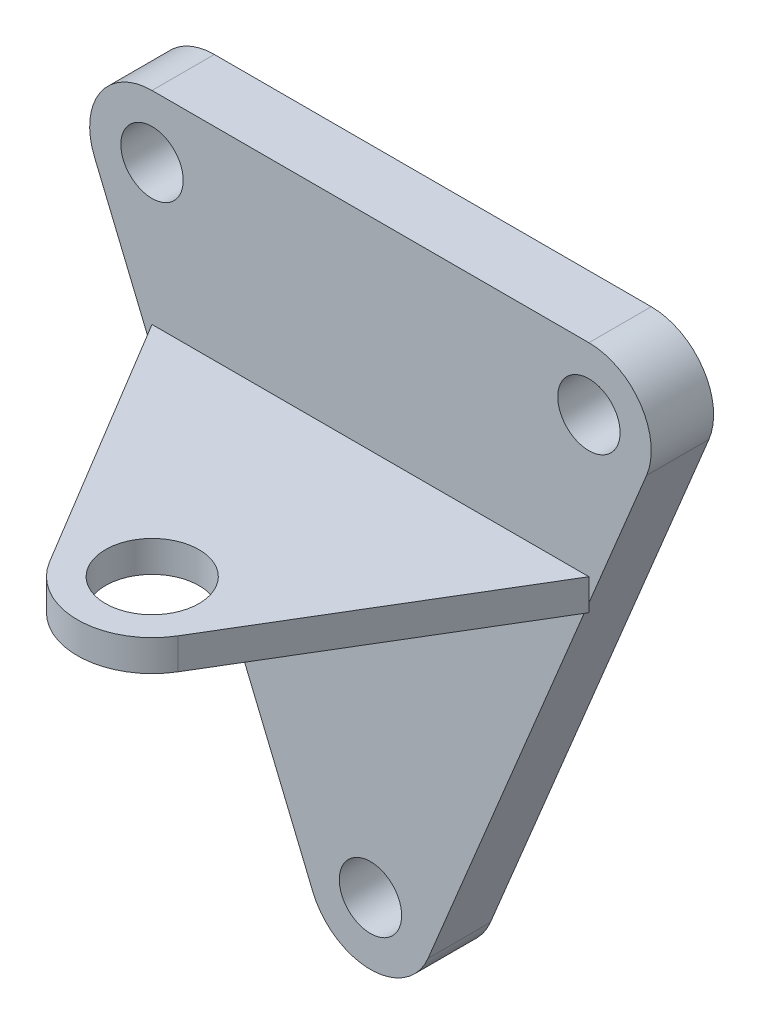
from build123d import *

# Parameters (mm, degrees)
SKETCH1_R      = 5
EXTRUDE1_DEPTH = 10
SKETCH3_R      = 7.5
EXTRUDE3_DEPTH = 2.5


with BuildPart() as part:
    # Sketch1 → Extrude1 (new body)
    with BuildSketch(Plane.XY):
        with BuildLine():
            Line((-35.033942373, 0), (35.033942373, 0))
            ThreePointArc((35.033942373, 0), (43.348638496, -4.44429767), (44.272737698, -13.826834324))
            Line((44.272737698, -13.826834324), (9.238795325, -98.406253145))
            ThreePointArc((9.238795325, -98.406253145), (0, -104.579418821), (-9.238795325, -98.406253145))
            Line((-9.238795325, -98.406253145), (-44.272737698, -13.826834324))
            ThreePointArc((-44.272737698, -13.826834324), (-43.348638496, -4.44429767), (-35.033942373, 0))
        make_face()
        with Locations((35.033942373, -10)):
            Circle(SKETCH1_R, mode=Mode.SUBTRACT)
        with Locations((-35.033942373, -10)):
            Circle(SKETCH1_R, mode=Mode.SUBTRACT)
        with Locations((0, -94.579418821)):
            Circle(SKETCH1_R, mode=Mode.SUBTRACT)
    extrude(amount=EXTRUDE1_DEPTH)

    # Sketch3 → Extrude3 (add, symmetric)
    with BuildSketch(Plane(origin=(0, -35, 0), x_dir=(-1, 0, 0), z_dir=(0, 1, 0))):
        with BuildLine():
            Line((35.033942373, 10), (-35.033942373, 10))
            Line((-35.033942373, 10), (-10.285542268, 51.181231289))
            ThreePointArc((-10.285542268, 51.181231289), (0, 57), (10.285542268, 51.181231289))
            Line((10.285542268, 51.181231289), (35.033942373, 10))
        make_face()
        with Locations(Location((0, 45, 0), (0, 0, 90))):
            Circle(SKETCH3_R, mode=Mode.SUBTRACT)
    extrude(amount=EXTRUDE3_DEPTH, both=True)


solid = part.part
